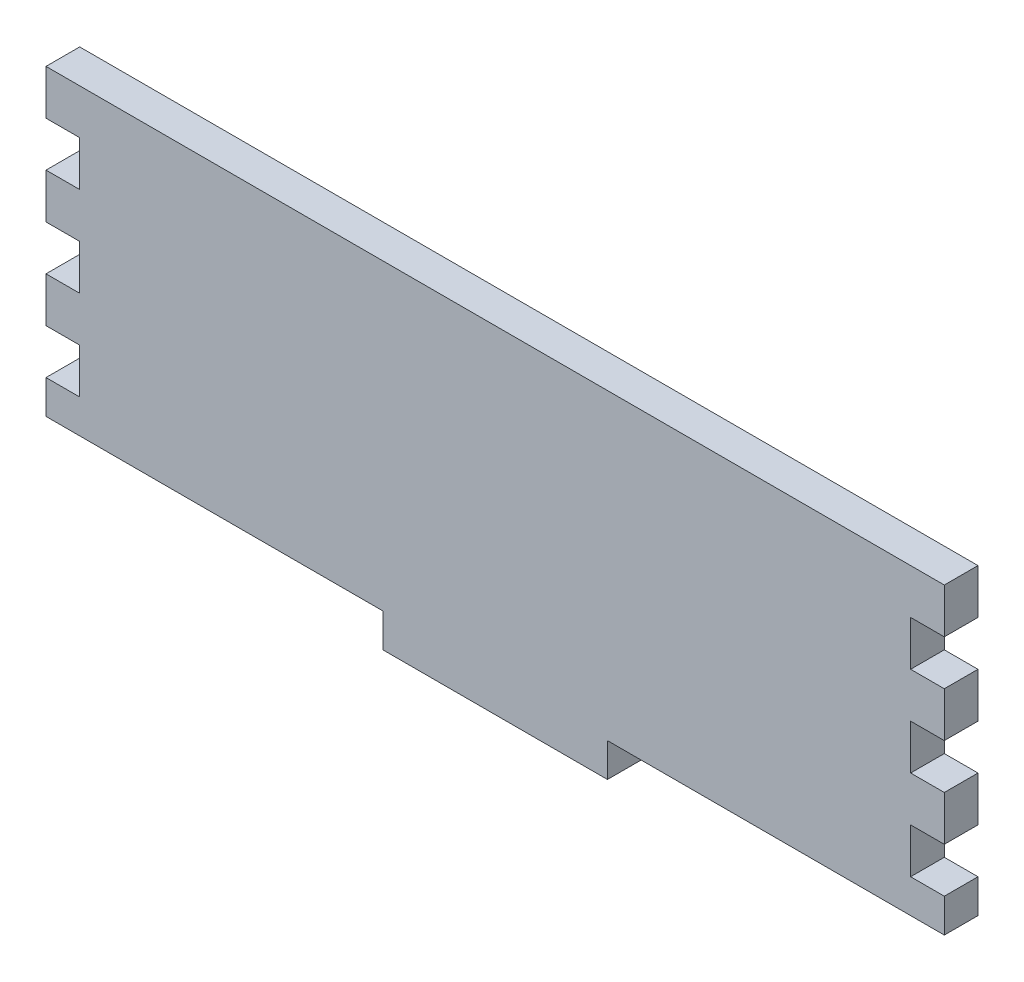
from build123d import *

# Parameters (mm, degrees)
SALIENTE_EXTRUIR1_DEPTH = 15
CROQUIS2_W              = 15
CROQUIS2_H              = 20
CORTAR_EXTRUIR1_DEPTH   = 215.126131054


with BuildPart() as part:
    # Croquis1 → Saliente-Extruir1 (new body)
    with BuildSketch(Plane.XY):
        Polygon((-200, -60), (-50, -60), (-50, -75), (50, -75), (50, -60), (200, -60), (200, 75), (-200, 75), align=None)
    extrude(amount=SALIENTE_EXTRUIR1_DEPTH)

    # Croquis2 → Cortar-Extruir1 (cut, through all)
    with BuildSketch(Plane.XY.offset(15)):
        with Locations((-192.5, 45)):
            Rectangle(CROQUIS2_W, CROQUIS2_H)
        with Locations((-192.5, 5)):
            Rectangle(CROQUIS2_W, CROQUIS2_H)
        with Locations((-192.5, -35)):
            Rectangle(CROQUIS2_W, CROQUIS2_H)
        with Locations((192.5, -35)):
            Rectangle(CROQUIS2_W, CROQUIS2_H)
        with Locations((192.5, 5)):
            Rectangle(CROQUIS2_W, CROQUIS2_H)
        with Locations((192.5, 45)):
            Rectangle(CROQUIS2_W, CROQUIS2_H)
    extrude(amount=-CORTAR_EXTRUIR1_DEPTH, mode=Mode.SUBTRACT)


solid = part.part
